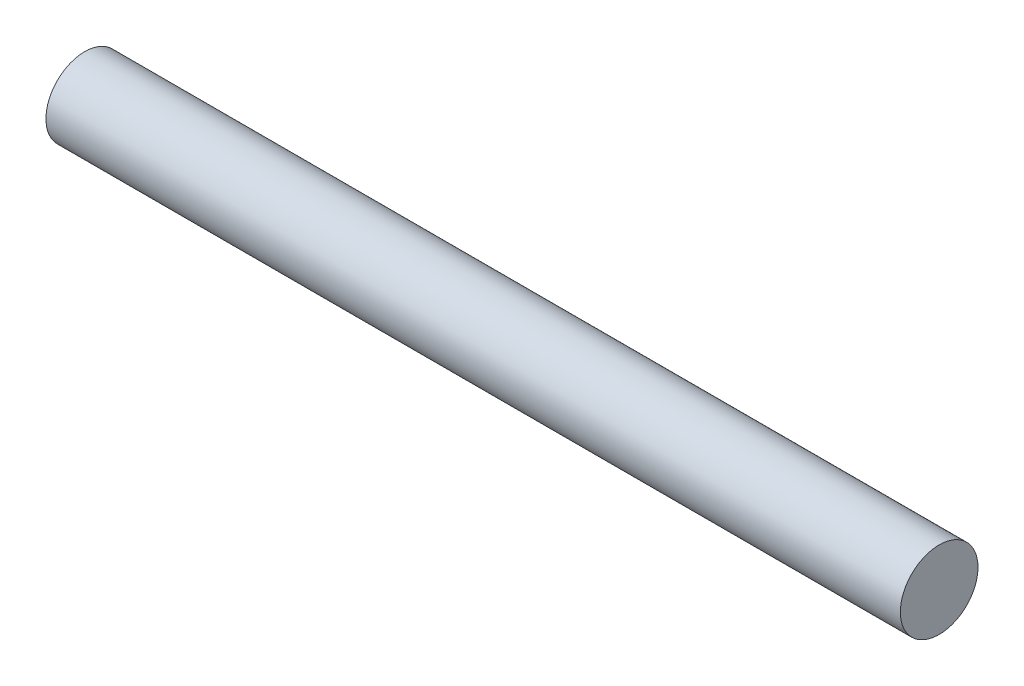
ISO-10303-21;
HEADER;
FILE_DESCRIPTION(('STEP AP214'),'2;1');
FILE_NAME('part.step','',(''),(''),'','','');
FILE_SCHEMA(('AUTOMOTIVE_DESIGN { 1 0 10303 214 1 1 1 1 }'));
ENDSEC;
DATA;
#1=APPLICATION_CONTEXT('core data for automotive mechanical design processes');
#2=APPLICATION_PROTOCOL_DEFINITION('international standard','automotive_design',2000,#1);
#3=PRODUCT_CONTEXT('',#1,'mechanical');
#4=PRODUCT('Part','Part','',(#3));
#5=PRODUCT_RELATED_PRODUCT_CATEGORY('part','',(#4));
#6=PRODUCT_DEFINITION_FORMATION('','',#4);
#7=PRODUCT_DEFINITION_CONTEXT('part definition',#1,'design');
#8=PRODUCT_DEFINITION('design','',#6,#7);
#9=PRODUCT_DEFINITION_SHAPE('','',#8);
#10=(LENGTH_UNIT() NAMED_UNIT(*) SI_UNIT(.MILLI.,.METRE.));
#11=(NAMED_UNIT(*) PLANE_ANGLE_UNIT() SI_UNIT($,.RADIAN.));
#12=(NAMED_UNIT(*) SI_UNIT($,.STERADIAN.) SOLID_ANGLE_UNIT());
#13=UNCERTAINTY_MEASURE_WITH_UNIT(LENGTH_MEASURE(1.E-05),#10,'distance_accuracy_value','');
#14=(GEOMETRIC_REPRESENTATION_CONTEXT(3) GLOBAL_UNCERTAINTY_ASSIGNED_CONTEXT((#13)) GLOBAL_UNIT_ASSIGNED_CONTEXT((#10,
#11,#12)) REPRESENTATION_CONTEXT('',''));
#15=CARTESIAN_POINT('',(0.,0.,0.));
#16=DIRECTION('',(0.,0.,1.));
#17=DIRECTION('',(1.,0.,0.));
#18=AXIS2_PLACEMENT_3D('',#15,#16,#17);
#19=CARTESIAN_POINT('',(220.,0.,0.));
#20=DIRECTION('',(-1.,0.,0.));
#21=DIRECTION('',(0.,0.,1.));
#22=AXIS2_PLACEMENT_3D('',#19,#20,#21);
#23=CYLINDRICAL_SURFACE('',#22,10.);
#24=CARTESIAN_POINT('',(220.,0.,0.));
#25=DIRECTION('',(1.,0.,0.));
#26=DIRECTION('',(0.,0.,-1.));
#27=AXIS2_PLACEMENT_3D('',#24,#25,#26);
#28=CIRCLE('',#27,10.);
#29=CARTESIAN_POINT('',(220.,0.,-10.));
#30=VERTEX_POINT('',#29);
#31=EDGE_CURVE('E10',#30,#30,#28,.T.);
#32=ORIENTED_EDGE('',*,*,#31,.F.);
#33=EDGE_LOOP('',(#32));
#34=FACE_BOUND('',#33,.T.);
#35=CARTESIAN_POINT('',(0.,0.,0.));
#36=DIRECTION('',(1.,0.,0.));
#37=DIRECTION('',(0.,0.,-1.));
#38=AXIS2_PLACEMENT_3D('',#35,#36,#37);
#39=CIRCLE('',#38,10.);
#40=CARTESIAN_POINT('',(0.,0.,-10.));
#41=VERTEX_POINT('',#40);
#42=EDGE_CURVE('E46',#41,#41,#39,.T.);
#43=ORIENTED_EDGE('',*,*,#42,.T.);
#44=EDGE_LOOP('',(#43));
#45=FACE_BOUND('',#44,.T.);
#46=ADVANCED_FACE('F43',(#34,#45),#23,.T.);
#47=CARTESIAN_POINT('',(220.,0.,0.));
#48=DIRECTION('',(1.,0.,0.));
#49=DIRECTION('',(0.,0.,-1.));
#50=AXIS2_PLACEMENT_3D('',#47,#48,#49);
#51=PLANE('',#50);
#52=ORIENTED_EDGE('',*,*,#31,.T.);
#53=EDGE_LOOP('',(#52));
#54=FACE_BOUND('',#53,.T.);
#55=ADVANCED_FACE('F60',(#54),#51,.T.);
#56=CARTESIAN_POINT('',(0.,0.,0.));
#57=DIRECTION('',(1.,0.,0.));
#58=DIRECTION('',(0.,0.,-1.));
#59=AXIS2_PLACEMENT_3D('',#56,#57,#58);
#60=PLANE('',#59);
#61=ORIENTED_EDGE('',*,*,#42,.F.);
#62=EDGE_LOOP('',(#61));
#63=FACE_BOUND('',#62,.T.);
#64=ADVANCED_FACE('F58',(#63),#60,.F.);
#65=CLOSED_SHELL('',(#46,#55,#64));
#66=MANIFOLD_SOLID_BREP('B2',#65);
#67=ADVANCED_BREP_SHAPE_REPRESENTATION('',(#18,#66),#14);
#68=SHAPE_DEFINITION_REPRESENTATION(#9,#67);
ENDSEC;
END-ISO-10303-21;
